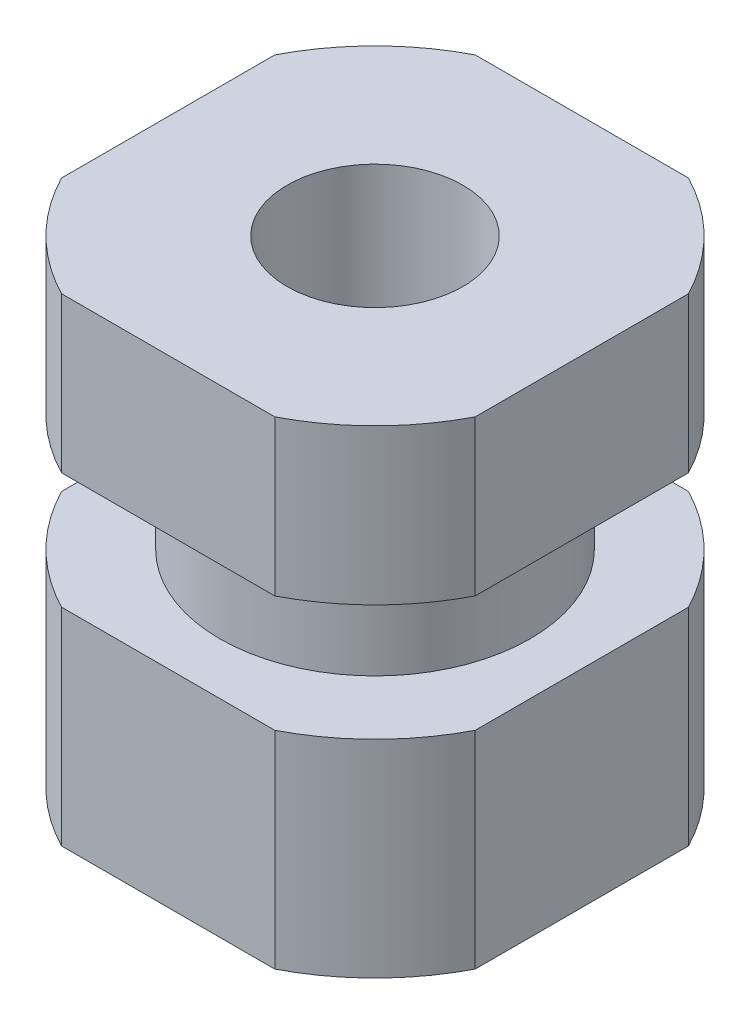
ISO-10303-21;
HEADER;
FILE_DESCRIPTION(('STEP AP214'),'2;1');
FILE_NAME('part.step','',(''),(''),'','','');
FILE_SCHEMA(('AUTOMOTIVE_DESIGN { 1 0 10303 214 1 1 1 1 }'));
ENDSEC;
DATA;
#1=APPLICATION_CONTEXT('core data for automotive mechanical design processes');
#2=APPLICATION_PROTOCOL_DEFINITION('international standard','automotive_design',2000,#1);
#3=PRODUCT_CONTEXT('',#1,'mechanical');
#4=PRODUCT('Part','Part','',(#3));
#5=PRODUCT_RELATED_PRODUCT_CATEGORY('part','',(#4));
#6=PRODUCT_DEFINITION_FORMATION('','',#4);
#7=PRODUCT_DEFINITION_CONTEXT('part definition',#1,'design');
#8=PRODUCT_DEFINITION('design','',#6,#7);
#9=PRODUCT_DEFINITION_SHAPE('','',#8);
#10=(LENGTH_UNIT() NAMED_UNIT(*) SI_UNIT(.MILLI.,.METRE.));
#11=(NAMED_UNIT(*) PLANE_ANGLE_UNIT() SI_UNIT($,.RADIAN.));
#12=(NAMED_UNIT(*) SI_UNIT($,.STERADIAN.) SOLID_ANGLE_UNIT());
#13=UNCERTAINTY_MEASURE_WITH_UNIT(LENGTH_MEASURE(1.E-05),#10,'distance_accuracy_value','');
#14=(GEOMETRIC_REPRESENTATION_CONTEXT(3) GLOBAL_UNCERTAINTY_ASSIGNED_CONTEXT((#13)) GLOBAL_UNIT_ASSIGNED_CONTEXT((#10,
#11,#12)) REPRESENTATION_CONTEXT('',''));
#15=CARTESIAN_POINT('',(0.,0.,0.));
#16=DIRECTION('',(0.,0.,1.));
#17=DIRECTION('',(1.,0.,0.));
#18=AXIS2_PLACEMENT_3D('',#15,#16,#17);
#19=CARTESIAN_POINT('',(-58.2970110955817,16.3639415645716,0.));
#20=DIRECTION('',(0.,-1.,0.));
#21=DIRECTION('',(0.,0.,-1.));
#22=AXIS2_PLACEMENT_3D('',#19,#20,#21);
#23=PLANE('',#22);
#24=CARTESIAN_POINT('',(-58.2970110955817,16.3639415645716,0.));
#25=DIRECTION('',(0.,1.,0.));
#26=DIRECTION('',(0.,0.,1.));
#27=AXIS2_PLACEMENT_3D('',#24,#25,#26);
#28=CIRCLE('',#27,3.4);
#29=CARTESIAN_POINT('',(-58.2970110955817,16.3639415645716,3.4));
#30=VERTEX_POINT('',#29);
#31=EDGE_CURVE('E290',#30,#30,#28,.T.);
#32=ORIENTED_EDGE('',*,*,#31,.T.);
#33=EDGE_LOOP('',(#32));
#34=FACE_BOUND('',#33,.T.);
#35=CARTESIAN_POINT('',(-58.2970110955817,16.3639415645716,0.));
#36=DIRECTION('',(0.,-1.,0.));
#37=DIRECTION('',(0.,0.,-1.));
#38=AXIS2_PLACEMENT_3D('',#35,#36,#37);
#39=CIRCLE('',#38,9.);
#40=CARTESIAN_POINT('',(-62.4201167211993,16.3639415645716,8.));
#41=VERTEX_POINT('',#40);
#42=CARTESIAN_POINT('',(-66.2970110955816,16.3639415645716,4.12310562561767));
#43=VERTEX_POINT('',#42);
#44=EDGE_CURVE('E322',#41,#43,#39,.T.);
#45=ORIENTED_EDGE('',*,*,#44,.T.);
#46=DIRECTION('',(0.,0.,1.));
#47=VECTOR('',#46,1.);
#48=CARTESIAN_POINT('',(-66.2970110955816,16.3639415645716,-8.));
#49=LINE('',#48,#47);
#50=CARTESIAN_POINT('',(-66.2970110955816,16.3639415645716,-4.12310562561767));
#51=VERTEX_POINT('',#50);
#52=EDGE_CURVE('E288',#51,#43,#49,.T.);
#53=ORIENTED_EDGE('',*,*,#52,.F.);
#54=CARTESIAN_POINT('',(-62.4201167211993,16.3639415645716,-8.));
#55=VERTEX_POINT('',#54);
#56=EDGE_CURVE('E179',#51,#55,#39,.T.);
#57=ORIENTED_EDGE('',*,*,#56,.T.);
#58=DIRECTION('',(-1.,0.,0.));
#59=VECTOR('',#58,1.);
#60=CARTESIAN_POINT('',(-50.2970110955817,16.3639415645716,-8.));
#61=LINE('',#60,#59);
#62=CARTESIAN_POINT('',(-54.173905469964,16.3639415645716,-8.));
#63=VERTEX_POINT('',#62);
#64=EDGE_CURVE('E280',#63,#55,#61,.T.);
#65=ORIENTED_EDGE('',*,*,#64,.F.);
#66=CARTESIAN_POINT('',(-50.2970110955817,16.3639415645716,-4.12310562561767));
#67=VERTEX_POINT('',#66);
#68=EDGE_CURVE('E139',#63,#67,#39,.T.);
#69=ORIENTED_EDGE('',*,*,#68,.T.);
#70=DIRECTION('',(0.,0.,-1.));
#71=VECTOR('',#70,1.);
#72=CARTESIAN_POINT('',(-50.2970110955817,16.3639415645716,-8.));
#73=LINE('',#72,#71);
#74=CARTESIAN_POINT('',(-50.2970110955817,16.3639415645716,4.12310562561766));
#75=VERTEX_POINT('',#74);
#76=EDGE_CURVE('E282',#75,#67,#73,.T.);
#77=ORIENTED_EDGE('',*,*,#76,.F.);
#78=CARTESIAN_POINT('',(-54.173905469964,16.3639415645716,8.));
#79=VERTEX_POINT('',#78);
#80=EDGE_CURVE('E182',#75,#79,#39,.T.);
#81=ORIENTED_EDGE('',*,*,#80,.T.);
#82=DIRECTION('',(1.,0.,0.));
#83=VECTOR('',#82,1.);
#84=CARTESIAN_POINT('',(-50.2970110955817,16.3639415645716,8.));
#85=LINE('',#84,#83);
#86=EDGE_CURVE('E286',#41,#79,#85,.T.);
#87=ORIENTED_EDGE('',*,*,#86,.F.);
#88=EDGE_LOOP('',(#45,#53,#57,#65,#69,#77,#81,#87));
#89=FACE_BOUND('',#88,.T.);
#90=ADVANCED_FACE('F16',(#34,#89),#23,.T.);
#91=CARTESIAN_POINT('',(-58.2970110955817,16.3639415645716,0.));
#92=DIRECTION('',(0.,-1.,0.));
#93=DIRECTION('',(0.,0.,-1.));
#94=AXIS2_PLACEMENT_3D('',#91,#92,#93);
#95=CYLINDRICAL_SURFACE('',#94,9.);
#96=ORIENTED_EDGE('',*,*,#56,.F.);
#97=DIRECTION('',(0.,-1.,0.));
#98=VECTOR('',#97,1.);
#99=CARTESIAN_POINT('',(-66.2970110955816,16.3639415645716,-4.12310562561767));
#100=LINE('',#99,#98);
#101=CARTESIAN_POINT('',(-66.2970110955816,24.3639415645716,-4.12310562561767));
#102=VERTEX_POINT('',#101);
#103=EDGE_CURVE('E159',#51,#102,#100,.F.);
#104=ORIENTED_EDGE('',*,*,#103,.T.);
#105=CARTESIAN_POINT('',(-58.2970110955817,24.3639415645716,0.));
#106=DIRECTION('',(0.,-1.,0.));
#107=DIRECTION('',(0.,0.,-1.));
#108=AXIS2_PLACEMENT_3D('',#105,#106,#107);
#109=CIRCLE('',#108,9.);
#110=CARTESIAN_POINT('',(-62.4201167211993,24.3639415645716,-8.));
#111=VERTEX_POINT('',#110);
#112=EDGE_CURVE('E175',#102,#111,#109,.T.);
#113=ORIENTED_EDGE('',*,*,#112,.T.);
#114=DIRECTION('',(0.,-1.,0.));
#115=VECTOR('',#114,1.);
#116=CARTESIAN_POINT('',(-62.4201167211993,16.3639415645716,-8.));
#117=LINE('',#116,#115);
#118=EDGE_CURVE('E30',#111,#55,#117,.T.);
#119=ORIENTED_EDGE('',*,*,#118,.T.);
#120=EDGE_LOOP('',(#96,#104,#113,#119));
#121=FACE_BOUND('',#120,.T.);
#122=ADVANCED_FACE('F215',(#121),#95,.T.);
#123=CARTESIAN_POINT('',(-62.4201167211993,24.3639415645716,8.));
#124=VERTEX_POINT('',#123);
#125=CARTESIAN_POINT('',(-66.2970110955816,24.3639415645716,4.12310562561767));
#126=VERTEX_POINT('',#125);
#127=EDGE_CURVE('E223',#124,#126,#109,.T.);
#128=ORIENTED_EDGE('',*,*,#127,.T.);
#129=DIRECTION('',(0.,-1.,0.));
#130=VECTOR('',#129,1.);
#131=CARTESIAN_POINT('',(-66.2970110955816,16.3639415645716,4.12310562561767));
#132=LINE('',#131,#130);
#133=EDGE_CURVE('E38',#126,#43,#132,.T.);
#134=ORIENTED_EDGE('',*,*,#133,.T.);
#135=ORIENTED_EDGE('',*,*,#44,.F.);
#136=DIRECTION('',(0.,-1.,0.));
#137=VECTOR('',#136,1.);
#138=CARTESIAN_POINT('',(-62.4201167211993,16.3639415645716,8.));
#139=LINE('',#138,#137);
#140=EDGE_CURVE('E240',#41,#124,#139,.F.);
#141=ORIENTED_EDGE('',*,*,#140,.T.);
#142=EDGE_LOOP('',(#128,#134,#135,#141));
#143=FACE_BOUND('',#142,.T.);
#144=ADVANCED_FACE('F318',(#143),#95,.T.);
#145=ORIENTED_EDGE('',*,*,#68,.F.);
#146=DIRECTION('',(0.,-1.,0.));
#147=VECTOR('',#146,1.);
#148=CARTESIAN_POINT('',(-54.173905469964,16.3639415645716,-8.));
#149=LINE('',#148,#147);
#150=CARTESIAN_POINT('',(-54.173905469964,24.3639415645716,-8.));
#151=VERTEX_POINT('',#150);
#152=EDGE_CURVE('E267',#63,#151,#149,.F.);
#153=ORIENTED_EDGE('',*,*,#152,.T.);
#154=CARTESIAN_POINT('',(-50.2970110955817,24.3639415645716,-4.12310562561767));
#155=VERTEX_POINT('',#154);
#156=EDGE_CURVE('E176',#151,#155,#109,.T.);
#157=ORIENTED_EDGE('',*,*,#156,.T.);
#158=DIRECTION('',(0.,-1.,0.));
#159=VECTOR('',#158,1.);
#160=CARTESIAN_POINT('',(-50.2970110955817,16.3639415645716,-4.12310562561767));
#161=LINE('',#160,#159);
#162=EDGE_CURVE('E255',#155,#67,#161,.T.);
#163=ORIENTED_EDGE('',*,*,#162,.T.);
#164=EDGE_LOOP('',(#145,#153,#157,#163));
#165=FACE_BOUND('',#164,.T.);
#166=ADVANCED_FACE('F327',(#165),#95,.T.);
#167=ORIENTED_EDGE('',*,*,#80,.F.);
#168=DIRECTION('',(0.,-1.,0.));
#169=VECTOR('',#168,1.);
#170=CARTESIAN_POINT('',(-50.2970110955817,16.3639415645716,4.12310562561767));
#171=LINE('',#170,#169);
#172=CARTESIAN_POINT('',(-50.2970110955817,24.3639415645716,4.12310562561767));
#173=VERTEX_POINT('',#172);
#174=EDGE_CURVE('E234',#75,#173,#171,.F.);
#175=ORIENTED_EDGE('',*,*,#174,.T.);
#176=CARTESIAN_POINT('',(-54.173905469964,24.3639415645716,8.));
#177=VERTEX_POINT('',#176);
#178=EDGE_CURVE('E180',#173,#177,#109,.T.);
#179=ORIENTED_EDGE('',*,*,#178,.T.);
#180=DIRECTION('',(0.,-1.,0.));
#181=VECTOR('',#180,1.);
#182=CARTESIAN_POINT('',(-54.173905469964,16.3639415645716,8.));
#183=LINE('',#182,#181);
#184=EDGE_CURVE('E232',#177,#79,#183,.T.);
#185=ORIENTED_EDGE('',*,*,#184,.T.);
#186=EDGE_LOOP('',(#167,#175,#179,#185));
#187=FACE_BOUND('',#186,.T.);
#188=ADVANCED_FACE('F231',(#187),#95,.T.);
#189=CARTESIAN_POINT('',(-49.2970110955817,24.3639415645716,0.));
#190=DIRECTION('',(0.,1.,0.));
#191=DIRECTION('',(0.,0.,1.));
#192=AXIS2_PLACEMENT_3D('',#189,#190,#191);
#193=PLANE('',#192);
#194=CARTESIAN_POINT('',(-58.2970110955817,24.3639415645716,0.));
#195=DIRECTION('',(0.,-1.,0.));
#196=DIRECTION('',(0.,0.,-1.));
#197=AXIS2_PLACEMENT_3D('',#194,#195,#196);
#198=CIRCLE('',#197,6.);
#199=CARTESIAN_POINT('',(-58.2970110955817,24.3639415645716,-6.));
#200=VERTEX_POINT('',#199);
#201=EDGE_CURVE('E172',#200,#200,#198,.T.);
#202=ORIENTED_EDGE('',*,*,#201,.T.);
#203=EDGE_LOOP('',(#202));
#204=FACE_BOUND('',#203,.T.);
#205=ORIENTED_EDGE('',*,*,#112,.F.);
#206=DIRECTION('',(0.,0.,1.));
#207=VECTOR('',#206,1.);
#208=CARTESIAN_POINT('',(-66.2970110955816,24.3639415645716,0.));
#209=LINE('',#208,#207);
#210=EDGE_CURVE('E199',#102,#126,#209,.T.);
#211=ORIENTED_EDGE('',*,*,#210,.T.);
#212=ORIENTED_EDGE('',*,*,#127,.F.);
#213=DIRECTION('',(1.,0.,0.));
#214=VECTOR('',#213,1.);
#215=CARTESIAN_POINT('',(-49.2970110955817,24.3639415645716,8.));
#216=LINE('',#215,#214);
#217=EDGE_CURVE('E149',#124,#177,#216,.T.);
#218=ORIENTED_EDGE('',*,*,#217,.T.);
#219=ORIENTED_EDGE('',*,*,#178,.F.);
#220=DIRECTION('',(0.,0.,-1.));
#221=VECTOR('',#220,1.);
#222=CARTESIAN_POINT('',(-50.2970110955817,24.3639415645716,0.));
#223=LINE('',#222,#221);
#224=EDGE_CURVE('E237',#173,#155,#223,.T.);
#225=ORIENTED_EDGE('',*,*,#224,.T.);
#226=ORIENTED_EDGE('',*,*,#156,.F.);
#227=DIRECTION('',(-1.,0.,0.));
#228=VECTOR('',#227,1.);
#229=CARTESIAN_POINT('',(-49.2970110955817,24.3639415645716,-8.));
#230=LINE('',#229,#228);
#231=EDGE_CURVE('E222',#151,#111,#230,.T.);
#232=ORIENTED_EDGE('',*,*,#231,.T.);
#233=EDGE_LOOP('',(#205,#211,#212,#218,#219,#225,#226,#232));
#234=FACE_BOUND('',#233,.T.);
#235=ADVANCED_FACE('F219',(#204,#234),#193,.T.);
#236=CARTESIAN_POINT('',(-52.2970110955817,28.8639415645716,0.));
#237=DIRECTION('',(0.,-1.,0.));
#238=DIRECTION('',(0.,0.,-1.));
#239=AXIS2_PLACEMENT_3D('',#236,#237,#238);
#240=PLANE('',#239);
#241=CARTESIAN_POINT('',(-58.2970110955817,28.8639415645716,0.));
#242=DIRECTION('',(0.,-1.,0.));
#243=DIRECTION('',(0.,0.,-1.));
#244=AXIS2_PLACEMENT_3D('',#241,#242,#243);
#245=CIRCLE('',#244,6.);
#246=CARTESIAN_POINT('',(-58.2970110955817,28.8639415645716,-6.));
#247=VERTEX_POINT('',#246);
#248=EDGE_CURVE('E168',#247,#247,#245,.T.);
#249=ORIENTED_EDGE('',*,*,#248,.F.);
#250=EDGE_LOOP('',(#249));
#251=FACE_BOUND('',#250,.T.);
#252=CARTESIAN_POINT('',(-58.2970110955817,28.8639415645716,0.));
#253=DIRECTION('',(0.,-1.,0.));
#254=DIRECTION('',(0.,0.,-1.));
#255=AXIS2_PLACEMENT_3D('',#252,#253,#254);
#256=CIRCLE('',#255,9.);
#257=CARTESIAN_POINT('',(-62.4201167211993,28.8639415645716,8.));
#258=VERTEX_POINT('',#257);
#259=CARTESIAN_POINT('',(-66.2970110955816,28.8639415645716,4.12310562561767));
#260=VERTEX_POINT('',#259);
#261=EDGE_CURVE('E148',#258,#260,#256,.T.);
#262=ORIENTED_EDGE('',*,*,#261,.T.);
#263=DIRECTION('',(0.,0.,-1.));
#264=VECTOR('',#263,1.);
#265=CARTESIAN_POINT('',(-66.2970110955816,28.8639415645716,0.));
#266=LINE('',#265,#264);
#267=CARTESIAN_POINT('',(-66.2970110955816,28.8639415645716,-4.12310562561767));
#268=VERTEX_POINT('',#267);
#269=EDGE_CURVE('E200',#260,#268,#266,.T.);
#270=ORIENTED_EDGE('',*,*,#269,.T.);
#271=CARTESIAN_POINT('',(-62.4201167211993,28.8639415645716,-8.));
#272=VERTEX_POINT('',#271);
#273=EDGE_CURVE('E163',#268,#272,#256,.T.);
#274=ORIENTED_EDGE('',*,*,#273,.T.);
#275=DIRECTION('',(1.,0.,0.));
#276=VECTOR('',#275,1.);
#277=CARTESIAN_POINT('',(-52.2970110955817,28.8639415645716,-8.));
#278=LINE('',#277,#276);
#279=CARTESIAN_POINT('',(-54.173905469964,28.8639415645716,-8.));
#280=VERTEX_POINT('',#279);
#281=EDGE_CURVE('E260',#272,#280,#278,.T.);
#282=ORIENTED_EDGE('',*,*,#281,.T.);
#283=CARTESIAN_POINT('',(-50.2970110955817,28.8639415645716,-4.12310562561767));
#284=VERTEX_POINT('',#283);
#285=EDGE_CURVE('E165',#280,#284,#256,.T.);
#286=ORIENTED_EDGE('',*,*,#285,.T.);
#287=DIRECTION('',(0.,0.,1.));
#288=VECTOR('',#287,1.);
#289=CARTESIAN_POINT('',(-50.2970110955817,28.8639415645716,0.));
#290=LINE('',#289,#288);
#291=CARTESIAN_POINT('',(-50.2970110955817,28.8639415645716,4.12310562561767));
#292=VERTEX_POINT('',#291);
#293=EDGE_CURVE('E248',#284,#292,#290,.T.);
#294=ORIENTED_EDGE('',*,*,#293,.T.);
#295=CARTESIAN_POINT('',(-54.173905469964,28.8639415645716,8.));
#296=VERTEX_POINT('',#295);
#297=EDGE_CURVE('E169',#292,#296,#256,.T.);
#298=ORIENTED_EDGE('',*,*,#297,.T.);
#299=DIRECTION('',(-1.,0.,0.));
#300=VECTOR('',#299,1.);
#301=CARTESIAN_POINT('',(-52.2970110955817,28.8639415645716,8.));
#302=LINE('',#301,#300);
#303=EDGE_CURVE('E150',#296,#258,#302,.T.);
#304=ORIENTED_EDGE('',*,*,#303,.T.);
#305=EDGE_LOOP('',(#262,#270,#274,#282,#286,#294,#298,#304));
#306=FACE_BOUND('',#305,.T.);
#307=ADVANCED_FACE('F270',(#251,#306),#240,.T.);
#308=CARTESIAN_POINT('',(-58.2970110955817,16.3639415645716,0.));
#309=DIRECTION('',(0.,-1.,0.));
#310=DIRECTION('',(0.,0.,-1.));
#311=AXIS2_PLACEMENT_3D('',#308,#309,#310);
#312=CYLINDRICAL_SURFACE('',#311,9.);
#313=ORIENTED_EDGE('',*,*,#273,.F.);
#314=DIRECTION('',(0.,-1.,0.));
#315=VECTOR('',#314,1.);
#316=CARTESIAN_POINT('',(-66.2970110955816,16.3639415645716,-4.12310562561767));
#317=LINE('',#316,#315);
#318=CARTESIAN_POINT('',(-66.2970110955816,34.8639415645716,-4.12310562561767));
#319=VERTEX_POINT('',#318);
#320=EDGE_CURVE('E196',#268,#319,#317,.F.);
#321=ORIENTED_EDGE('',*,*,#320,.T.);
#322=CARTESIAN_POINT('',(-58.2970110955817,34.8639415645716,0.));
#323=DIRECTION('',(0.,-1.,0.));
#324=DIRECTION('',(0.,0.,-1.));
#325=AXIS2_PLACEMENT_3D('',#322,#323,#324);
#326=CIRCLE('',#325,9.);
#327=CARTESIAN_POINT('',(-62.4201167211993,34.8639415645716,-8.));
#328=VERTEX_POINT('',#327);
#329=EDGE_CURVE('E155',#319,#328,#326,.T.);
#330=ORIENTED_EDGE('',*,*,#329,.T.);
#331=DIRECTION('',(0.,-1.,0.));
#332=VECTOR('',#331,1.);
#333=CARTESIAN_POINT('',(-62.4201167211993,16.3639415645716,-8.));
#334=LINE('',#333,#332);
#335=EDGE_CURVE('E194',#328,#272,#334,.T.);
#336=ORIENTED_EDGE('',*,*,#335,.T.);
#337=EDGE_LOOP('',(#313,#321,#330,#336));
#338=FACE_BOUND('',#337,.T.);
#339=ADVANCED_FACE('F193',(#338),#312,.T.);
#340=CARTESIAN_POINT('',(-62.4201167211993,34.8639415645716,8.));
#341=VERTEX_POINT('',#340);
#342=CARTESIAN_POINT('',(-66.2970110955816,34.8639415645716,4.12310562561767));
#343=VERTEX_POINT('',#342);
#344=EDGE_CURVE('E146',#341,#343,#326,.T.);
#345=ORIENTED_EDGE('',*,*,#344,.T.);
#346=DIRECTION('',(0.,-1.,0.));
#347=VECTOR('',#346,1.);
#348=CARTESIAN_POINT('',(-66.2970110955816,16.3639415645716,4.12310562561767));
#349=LINE('',#348,#347);
#350=EDGE_CURVE('E203',#343,#260,#349,.T.);
#351=ORIENTED_EDGE('',*,*,#350,.T.);
#352=ORIENTED_EDGE('',*,*,#261,.F.);
#353=DIRECTION('',(0.,-1.,0.));
#354=VECTOR('',#353,1.);
#355=CARTESIAN_POINT('',(-62.4201167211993,16.3639415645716,8.));
#356=LINE('',#355,#354);
#357=EDGE_CURVE('E130',#258,#341,#356,.F.);
#358=ORIENTED_EDGE('',*,*,#357,.T.);
#359=EDGE_LOOP('',(#345,#351,#352,#358));
#360=FACE_BOUND('',#359,.T.);
#361=ADVANCED_FACE('F144',(#360),#312,.T.);
#362=ORIENTED_EDGE('',*,*,#285,.F.);
#363=DIRECTION('',(0.,-1.,0.));
#364=VECTOR('',#363,1.);
#365=CARTESIAN_POINT('',(-54.173905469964,16.3639415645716,-8.));
#366=LINE('',#365,#364);
#367=CARTESIAN_POINT('',(-54.173905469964,34.8639415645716,-8.));
#368=VERTEX_POINT('',#367);
#369=EDGE_CURVE('E263',#280,#368,#366,.F.);
#370=ORIENTED_EDGE('',*,*,#369,.T.);
#371=CARTESIAN_POINT('',(-50.2970110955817,34.8639415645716,-4.12310562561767));
#372=VERTEX_POINT('',#371);
#373=EDGE_CURVE('E157',#368,#372,#326,.T.);
#374=ORIENTED_EDGE('',*,*,#373,.T.);
#375=DIRECTION('',(0.,-1.,0.));
#376=VECTOR('',#375,1.);
#377=CARTESIAN_POINT('',(-50.2970110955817,16.3639415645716,-4.12310562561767));
#378=LINE('',#377,#376);
#379=EDGE_CURVE('E245',#372,#284,#378,.T.);
#380=ORIENTED_EDGE('',*,*,#379,.T.);
#381=EDGE_LOOP('',(#362,#370,#374,#380));
#382=FACE_BOUND('',#381,.T.);
#383=ADVANCED_FACE('F274',(#382),#312,.T.);
#384=ORIENTED_EDGE('',*,*,#297,.F.);
#385=DIRECTION('',(0.,-1.,0.));
#386=VECTOR('',#385,1.);
#387=CARTESIAN_POINT('',(-50.2970110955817,16.3639415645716,4.12310562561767));
#388=LINE('',#387,#386);
#389=CARTESIAN_POINT('',(-50.2970110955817,34.8639415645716,4.12310562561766));
#390=VERTEX_POINT('',#389);
#391=EDGE_CURVE('E251',#292,#390,#388,.F.);
#392=ORIENTED_EDGE('',*,*,#391,.T.);
#393=CARTESIAN_POINT('',(-54.173905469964,34.8639415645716,8.));
#394=VERTEX_POINT('',#393);
#395=EDGE_CURVE('E154',#390,#394,#326,.T.);
#396=ORIENTED_EDGE('',*,*,#395,.T.);
#397=DIRECTION('',(0.,-1.,0.));
#398=VECTOR('',#397,1.);
#399=CARTESIAN_POINT('',(-54.173905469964,16.3639415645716,8.));
#400=LINE('',#399,#398);
#401=EDGE_CURVE('E133',#394,#296,#400,.T.);
#402=ORIENTED_EDGE('',*,*,#401,.T.);
#403=EDGE_LOOP('',(#384,#392,#396,#402));
#404=FACE_BOUND('',#403,.T.);
#405=ADVANCED_FACE('F279',(#404),#312,.T.);
#406=CARTESIAN_POINT('',(-49.2970110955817,34.8639415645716,0.));
#407=DIRECTION('',(0.,1.,0.));
#408=DIRECTION('',(0.,0.,1.));
#409=AXIS2_PLACEMENT_3D('',#406,#407,#408);
#410=PLANE('',#409);
#411=CARTESIAN_POINT('',(-58.2970110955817,34.8639415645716,0.));
#412=DIRECTION('',(0.,1.,0.));
#413=DIRECTION('',(0.,0.,1.));
#414=AXIS2_PLACEMENT_3D('',#411,#412,#413);
#415=CIRCLE('',#414,3.4);
#416=CARTESIAN_POINT('',(-58.2970110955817,34.8639415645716,3.4));
#417=VERTEX_POINT('',#416);
#418=EDGE_CURVE('E293',#417,#417,#415,.T.);
#419=ORIENTED_EDGE('',*,*,#418,.F.);
#420=EDGE_LOOP('',(#419));
#421=FACE_BOUND('',#420,.T.);
#422=ORIENTED_EDGE('',*,*,#329,.F.);
#423=DIRECTION('',(0.,0.,1.));
#424=VECTOR('',#423,1.);
#425=CARTESIAN_POINT('',(-66.2970110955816,34.8639415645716,0.));
#426=LINE('',#425,#424);
#427=EDGE_CURVE('E11',#319,#343,#426,.T.);
#428=ORIENTED_EDGE('',*,*,#427,.T.);
#429=ORIENTED_EDGE('',*,*,#344,.F.);
#430=DIRECTION('',(1.,0.,0.));
#431=VECTOR('',#430,1.);
#432=CARTESIAN_POINT('',(-49.2970110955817,34.8639415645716,8.));
#433=LINE('',#432,#431);
#434=EDGE_CURVE('E127',#341,#394,#433,.T.);
#435=ORIENTED_EDGE('',*,*,#434,.T.);
#436=ORIENTED_EDGE('',*,*,#395,.F.);
#437=DIRECTION('',(0.,0.,-1.));
#438=VECTOR('',#437,1.);
#439=CARTESIAN_POINT('',(-50.2970110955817,34.8639415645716,0.));
#440=LINE('',#439,#438);
#441=EDGE_CURVE('E138',#390,#372,#440,.T.);
#442=ORIENTED_EDGE('',*,*,#441,.T.);
#443=ORIENTED_EDGE('',*,*,#373,.F.);
#444=DIRECTION('',(-1.,0.,0.));
#445=VECTOR('',#444,1.);
#446=CARTESIAN_POINT('',(-49.2970110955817,34.8639415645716,-8.));
#447=LINE('',#446,#445);
#448=EDGE_CURVE('E23',#368,#328,#447,.T.);
#449=ORIENTED_EDGE('',*,*,#448,.T.);
#450=EDGE_LOOP('',(#422,#428,#429,#435,#436,#442,#443,#449));
#451=FACE_BOUND('',#450,.T.);
#452=ADVANCED_FACE('F153',(#421,#451),#410,.T.);
#453=CARTESIAN_POINT('',(-58.2970110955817,16.3639415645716,0.));
#454=DIRECTION('',(0.,-1.,0.));
#455=DIRECTION('',(0.,0.,-1.));
#456=AXIS2_PLACEMENT_3D('',#453,#454,#455);
#457=CYLINDRICAL_SURFACE('',#456,6.);
#458=ORIENTED_EDGE('',*,*,#248,.T.);
#459=EDGE_LOOP('',(#458));
#460=FACE_BOUND('',#459,.T.);
#461=ORIENTED_EDGE('',*,*,#201,.F.);
#462=EDGE_LOOP('',(#461));
#463=FACE_BOUND('',#462,.T.);
#464=ADVANCED_FACE('F300',(#460,#463),#457,.T.);
#465=CARTESIAN_POINT('',(-50.2970110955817,16.3639415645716,8.));
#466=DIRECTION('',(0.,0.,1.));
#467=DIRECTION('',(1.,0.,0.));
#468=AXIS2_PLACEMENT_3D('',#465,#466,#467);
#469=PLANE('',#468);
#470=ORIENTED_EDGE('',*,*,#303,.F.);
#471=ORIENTED_EDGE('',*,*,#401,.F.);
#472=ORIENTED_EDGE('',*,*,#434,.F.);
#473=ORIENTED_EDGE('',*,*,#357,.F.);
#474=EDGE_LOOP('',(#470,#471,#472,#473));
#475=FACE_BOUND('',#474,.T.);
#476=ADVANCED_FACE('F129',(#475),#469,.T.);
#477=CARTESIAN_POINT('',(-50.2970110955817,16.3639415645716,-8.));
#478=DIRECTION('',(1.,0.,0.));
#479=DIRECTION('',(0.,0.,-1.));
#480=AXIS2_PLACEMENT_3D('',#477,#478,#479);
#481=PLANE('',#480);
#482=ORIENTED_EDGE('',*,*,#293,.F.);
#483=ORIENTED_EDGE('',*,*,#379,.F.);
#484=ORIENTED_EDGE('',*,*,#441,.F.);
#485=ORIENTED_EDGE('',*,*,#391,.F.);
#486=EDGE_LOOP('',(#482,#483,#484,#485));
#487=FACE_BOUND('',#486,.T.);
#488=ADVANCED_FACE('F276',(#487),#481,.T.);
#489=CARTESIAN_POINT('',(-50.2970110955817,16.3639415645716,-8.));
#490=DIRECTION('',(0.,0.,-1.));
#491=DIRECTION('',(-1.,0.,0.));
#492=AXIS2_PLACEMENT_3D('',#489,#490,#491);
#493=PLANE('',#492);
#494=ORIENTED_EDGE('',*,*,#281,.F.);
#495=ORIENTED_EDGE('',*,*,#335,.F.);
#496=ORIENTED_EDGE('',*,*,#448,.F.);
#497=ORIENTED_EDGE('',*,*,#369,.F.);
#498=EDGE_LOOP('',(#494,#495,#496,#497));
#499=FACE_BOUND('',#498,.T.);
#500=ADVANCED_FACE('F341',(#499),#493,.T.);
#501=CARTESIAN_POINT('',(-66.2970110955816,16.3639415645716,-8.));
#502=DIRECTION('',(-1.,0.,0.));
#503=DIRECTION('',(0.,0.,1.));
#504=AXIS2_PLACEMENT_3D('',#501,#502,#503);
#505=PLANE('',#504);
#506=ORIENTED_EDGE('',*,*,#269,.F.);
#507=ORIENTED_EDGE('',*,*,#350,.F.);
#508=ORIENTED_EDGE('',*,*,#427,.F.);
#509=ORIENTED_EDGE('',*,*,#320,.F.);
#510=EDGE_LOOP('',(#506,#507,#508,#509));
#511=FACE_BOUND('',#510,.T.);
#512=ADVANCED_FACE('F342',(#511),#505,.T.);
#513=ORIENTED_EDGE('',*,*,#86,.T.);
#514=ORIENTED_EDGE('',*,*,#184,.F.);
#515=ORIENTED_EDGE('',*,*,#217,.F.);
#516=ORIENTED_EDGE('',*,*,#140,.F.);
#517=EDGE_LOOP('',(#513,#514,#515,#516));
#518=FACE_BOUND('',#517,.T.);
#519=ADVANCED_FACE('F332',(#518),#469,.T.);
#520=ORIENTED_EDGE('',*,*,#76,.T.);
#521=ORIENTED_EDGE('',*,*,#162,.F.);
#522=ORIENTED_EDGE('',*,*,#224,.F.);
#523=ORIENTED_EDGE('',*,*,#174,.F.);
#524=EDGE_LOOP('',(#520,#521,#522,#523));
#525=FACE_BOUND('',#524,.T.);
#526=ADVANCED_FACE('F329',(#525),#481,.T.);
#527=ORIENTED_EDGE('',*,*,#64,.T.);
#528=ORIENTED_EDGE('',*,*,#118,.F.);
#529=ORIENTED_EDGE('',*,*,#231,.F.);
#530=ORIENTED_EDGE('',*,*,#152,.F.);
#531=EDGE_LOOP('',(#527,#528,#529,#530));
#532=FACE_BOUND('',#531,.T.);
#533=ADVANCED_FACE('F331',(#532),#493,.T.);
#534=ORIENTED_EDGE('',*,*,#52,.T.);
#535=ORIENTED_EDGE('',*,*,#133,.F.);
#536=ORIENTED_EDGE('',*,*,#210,.F.);
#537=ORIENTED_EDGE('',*,*,#103,.F.);
#538=EDGE_LOOP('',(#534,#535,#536,#537));
#539=FACE_BOUND('',#538,.T.);
#540=ADVANCED_FACE('F339',(#539),#505,.T.);
#541=CARTESIAN_POINT('',(-58.2970110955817,34.8639415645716,0.));
#542=DIRECTION('',(0.,1.,0.));
#543=DIRECTION('',(0.,0.,1.));
#544=AXIS2_PLACEMENT_3D('',#541,#542,#543);
#545=CYLINDRICAL_SURFACE('',#544,3.4);
#546=ORIENTED_EDGE('',*,*,#31,.F.);
#547=EDGE_LOOP('',(#546));
#548=FACE_BOUND('',#547,.T.);
#549=ORIENTED_EDGE('',*,*,#418,.T.);
#550=EDGE_LOOP('',(#549));
#551=FACE_BOUND('',#550,.T.);
#552=ADVANCED_FACE('F297',(#548,#551),#545,.F.);
#553=CLOSED_SHELL('',(#90,#122,#144,#166,#188,#235,#307,#339,#361,#383,#405,#452,#464,#476,#488,
#500,#512,#519,#526,#533,#540,#552));
#554=MANIFOLD_SOLID_BREP('B1',#553);
#555=ADVANCED_BREP_SHAPE_REPRESENTATION('',(#18,#554),#14);
#556=SHAPE_DEFINITION_REPRESENTATION(#9,#555);
ENDSEC;
END-ISO-10303-21;
